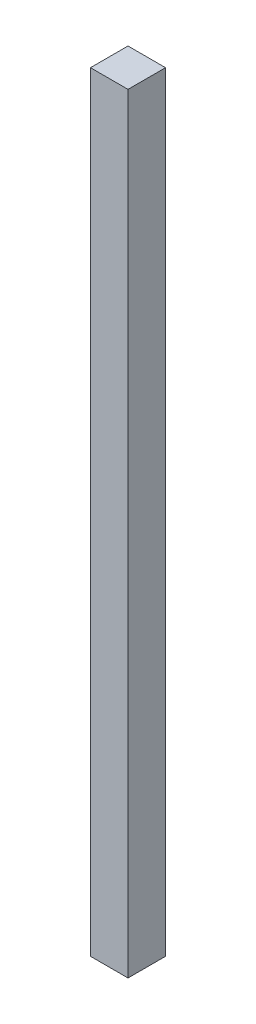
ISO-10303-21;
HEADER;
FILE_DESCRIPTION(('STEP AP214'),'2;1');
FILE_NAME('part.step','',(''),(''),'','','');
FILE_SCHEMA(('AUTOMOTIVE_DESIGN { 1 0 10303 214 1 1 1 1 }'));
ENDSEC;
DATA;
#1=APPLICATION_CONTEXT('core data for automotive mechanical design processes');
#2=APPLICATION_PROTOCOL_DEFINITION('international standard','automotive_design',2000,#1);
#3=PRODUCT_CONTEXT('',#1,'mechanical');
#4=PRODUCT('Part','Part','',(#3));
#5=PRODUCT_RELATED_PRODUCT_CATEGORY('part','',(#4));
#6=PRODUCT_DEFINITION_FORMATION('','',#4);
#7=PRODUCT_DEFINITION_CONTEXT('part definition',#1,'design');
#8=PRODUCT_DEFINITION('design','',#6,#7);
#9=PRODUCT_DEFINITION_SHAPE('','',#8);
#10=(LENGTH_UNIT() NAMED_UNIT(*) SI_UNIT(.MILLI.,.METRE.));
#11=(NAMED_UNIT(*) PLANE_ANGLE_UNIT() SI_UNIT($,.RADIAN.));
#12=(NAMED_UNIT(*) SI_UNIT($,.STERADIAN.) SOLID_ANGLE_UNIT());
#13=UNCERTAINTY_MEASURE_WITH_UNIT(LENGTH_MEASURE(1.E-05),#10,'distance_accuracy_value','');
#14=(GEOMETRIC_REPRESENTATION_CONTEXT(3) GLOBAL_UNCERTAINTY_ASSIGNED_CONTEXT((#13)) GLOBAL_UNIT_ASSIGNED_CONTEXT((#10,
#11,#12)) REPRESENTATION_CONTEXT('',''));
#15=CARTESIAN_POINT('',(0.,0.,0.));
#16=DIRECTION('',(0.,0.,1.));
#17=DIRECTION('',(1.,0.,0.));
#18=AXIS2_PLACEMENT_3D('',#15,#16,#17);
#19=CARTESIAN_POINT('',(-40.0000000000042,-4.97121842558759E-12,-40.));
#20=DIRECTION('',(-1.,0.,0.));
#21=DIRECTION('',(0.,0.,1.));
#22=AXIS2_PLACEMENT_3D('',#19,#20,#21);
#23=PLANE('',#22);
#24=DIRECTION('',(0.,-1.,0.));
#25=VECTOR('',#24,1.);
#26=CARTESIAN_POINT('',(-40.0000000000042,-4.97121842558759E-12,0.));
#27=LINE('',#26,#25);
#28=CARTESIAN_POINT('',(-40.0000000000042,819.999999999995,0.));
#29=VERTEX_POINT('',#28);
#30=CARTESIAN_POINT('',(-40.0000000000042,-4.97121842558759E-12,0.));
#31=VERTEX_POINT('',#30);
#32=EDGE_CURVE('E97',#29,#31,#27,.T.);
#33=ORIENTED_EDGE('',*,*,#32,.F.);
#34=DIRECTION('',(0.,0.,1.));
#35=VECTOR('',#34,1.);
#36=CARTESIAN_POINT('',(-40.0000000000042,819.999999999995,-40.));
#37=LINE('',#36,#35);
#38=CARTESIAN_POINT('',(-40.0000000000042,819.999999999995,-40.));
#39=VERTEX_POINT('',#38);
#40=EDGE_CURVE('E11',#39,#29,#37,.T.);
#41=ORIENTED_EDGE('',*,*,#40,.F.);
#42=DIRECTION('',(0.,-1.,0.));
#43=VECTOR('',#42,1.);
#44=CARTESIAN_POINT('',(-40.0000000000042,-4.97121842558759E-12,-40.));
#45=LINE('',#44,#43);
#46=CARTESIAN_POINT('',(-40.0000000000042,-4.97121842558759E-12,-40.));
#47=VERTEX_POINT('',#46);
#48=EDGE_CURVE('E91',#39,#47,#45,.T.);
#49=ORIENTED_EDGE('',*,*,#48,.T.);
#50=DIRECTION('',(0.,0.,1.));
#51=VECTOR('',#50,1.);
#52=CARTESIAN_POINT('',(-40.0000000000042,-4.97121842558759E-12,-40.));
#53=LINE('',#52,#51);
#54=EDGE_CURVE('E36',#47,#31,#53,.T.);
#55=ORIENTED_EDGE('',*,*,#54,.T.);
#56=EDGE_LOOP('',(#33,#41,#49,#55));
#57=FACE_BOUND('',#56,.T.);
#58=ADVANCED_FACE('F33',(#57),#23,.T.);
#59=CARTESIAN_POINT('',(-40.0000000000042,819.999999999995,-40.));
#60=DIRECTION('',(0.,1.,0.));
#61=DIRECTION('',(0.,0.,1.));
#62=AXIS2_PLACEMENT_3D('',#59,#60,#61);
#63=PLANE('',#62);
#64=DIRECTION('',(-1.,0.,0.));
#65=VECTOR('',#64,1.);
#66=CARTESIAN_POINT('',(-40.0000000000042,819.999999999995,0.));
#67=LINE('',#66,#65);
#68=CARTESIAN_POINT('',(-1.62729517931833E-11,819.999999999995,0.));
#69=VERTEX_POINT('',#68);
#70=EDGE_CURVE('E93',#69,#29,#67,.T.);
#71=ORIENTED_EDGE('',*,*,#70,.F.);
#72=DIRECTION('',(0.,0.,1.));
#73=VECTOR('',#72,1.);
#74=CARTESIAN_POINT('',(-1.62729517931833E-11,819.999999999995,-40.));
#75=LINE('',#74,#73);
#76=CARTESIAN_POINT('',(-1.62729517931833E-11,819.999999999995,-40.));
#77=VERTEX_POINT('',#76);
#78=EDGE_CURVE('E42',#77,#69,#75,.T.);
#79=ORIENTED_EDGE('',*,*,#78,.F.);
#80=DIRECTION('',(-1.,0.,0.));
#81=VECTOR('',#80,1.);
#82=CARTESIAN_POINT('',(-40.0000000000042,819.999999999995,-40.));
#83=LINE('',#82,#81);
#84=EDGE_CURVE('E88',#77,#39,#83,.T.);
#85=ORIENTED_EDGE('',*,*,#84,.T.);
#86=ORIENTED_EDGE('',*,*,#40,.T.);
#87=EDGE_LOOP('',(#71,#79,#85,#86));
#88=FACE_BOUND('',#87,.T.);
#89=ADVANCED_FACE('F107',(#88),#63,.T.);
#90=CARTESIAN_POINT('',(0.,0.,-40.));
#91=DIRECTION('',(1.,0.,0.));
#92=DIRECTION('',(0.,1.,0.));
#93=AXIS2_PLACEMENT_3D('',#90,#91,#92);
#94=PLANE('',#93);
#95=DIRECTION('',(0.,1.,0.));
#96=VECTOR('',#95,1.);
#97=CARTESIAN_POINT('',(0.,0.,0.));
#98=LINE('',#97,#96);
#99=CARTESIAN_POINT('',(0.,0.,0.));
#100=VERTEX_POINT('',#99);
#101=EDGE_CURVE('E83',#100,#69,#98,.T.);
#102=ORIENTED_EDGE('',*,*,#101,.F.);
#103=DIRECTION('',(0.,0.,1.));
#104=VECTOR('',#103,1.);
#105=CARTESIAN_POINT('',(0.,0.,-40.));
#106=LINE('',#105,#104);
#107=CARTESIAN_POINT('',(0.,0.,-40.));
#108=VERTEX_POINT('',#107);
#109=EDGE_CURVE('E78',#108,#100,#106,.T.);
#110=ORIENTED_EDGE('',*,*,#109,.F.);
#111=DIRECTION('',(0.,1.,0.));
#112=VECTOR('',#111,1.);
#113=CARTESIAN_POINT('',(0.,0.,-40.));
#114=LINE('',#113,#112);
#115=EDGE_CURVE('E81',#108,#77,#114,.T.);
#116=ORIENTED_EDGE('',*,*,#115,.T.);
#117=ORIENTED_EDGE('',*,*,#78,.T.);
#118=EDGE_LOOP('',(#102,#110,#116,#117));
#119=FACE_BOUND('',#118,.T.);
#120=ADVANCED_FACE('F80',(#119),#94,.T.);
#121=CARTESIAN_POINT('',(-40.0000000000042,-4.97121842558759E-12,-40.));
#122=DIRECTION('',(1.24280460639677E-13,-1.,0.));
#123=DIRECTION('',(1.,1.24280460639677E-13,0.));
#124=AXIS2_PLACEMENT_3D('',#121,#122,#123);
#125=PLANE('',#124);
#126=DIRECTION('',(1.,1.24280460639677E-13,0.));
#127=VECTOR('',#126,1.);
#128=CARTESIAN_POINT('',(-40.0000000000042,-4.97121842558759E-12,0.));
#129=LINE('',#128,#127);
#130=EDGE_CURVE('E100',#31,#100,#129,.T.);
#131=ORIENTED_EDGE('',*,*,#130,.F.);
#132=ORIENTED_EDGE('',*,*,#54,.F.);
#133=DIRECTION('',(1.,1.24280460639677E-13,0.));
#134=VECTOR('',#133,1.);
#135=CARTESIAN_POINT('',(-40.0000000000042,-4.97121842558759E-12,-40.));
#136=LINE('',#135,#134);
#137=EDGE_CURVE('E87',#47,#108,#136,.T.);
#138=ORIENTED_EDGE('',*,*,#137,.T.);
#139=ORIENTED_EDGE('',*,*,#109,.T.);
#140=EDGE_LOOP('',(#131,#132,#138,#139));
#141=FACE_BOUND('',#140,.T.);
#142=ADVANCED_FACE('F90',(#141),#125,.T.);
#143=CARTESIAN_POINT('',(0.,0.,-40.));
#144=DIRECTION('',(0.,0.,-1.));
#145=DIRECTION('',(-1.,0.,0.));
#146=AXIS2_PLACEMENT_3D('',#143,#144,#145);
#147=PLANE('',#146);
#148=ORIENTED_EDGE('',*,*,#48,.F.);
#149=ORIENTED_EDGE('',*,*,#84,.F.);
#150=ORIENTED_EDGE('',*,*,#115,.F.);
#151=ORIENTED_EDGE('',*,*,#137,.F.);
#152=EDGE_LOOP('',(#148,#149,#150,#151));
#153=FACE_BOUND('',#152,.T.);
#154=ADVANCED_FACE('F86',(#153),#147,.T.);
#155=CARTESIAN_POINT('',(0.,0.,0.));
#156=DIRECTION('',(0.,0.,-1.));
#157=DIRECTION('',(-1.,0.,0.));
#158=AXIS2_PLACEMENT_3D('',#155,#156,#157);
#159=PLANE('',#158);
#160=ORIENTED_EDGE('',*,*,#32,.T.);
#161=ORIENTED_EDGE('',*,*,#130,.T.);
#162=ORIENTED_EDGE('',*,*,#101,.T.);
#163=ORIENTED_EDGE('',*,*,#70,.T.);
#164=EDGE_LOOP('',(#160,#161,#162,#163));
#165=FACE_BOUND('',#164,.T.);
#166=ADVANCED_FACE('F106',(#165),#159,.F.);
#167=CLOSED_SHELL('',(#58,#89,#120,#142,#154,#166));
#168=MANIFOLD_SOLID_BREP('B2',#167);
#169=ADVANCED_BREP_SHAPE_REPRESENTATION('',(#18,#168),#14);
#170=SHAPE_DEFINITION_REPRESENTATION(#9,#169);
ENDSEC;
END-ISO-10303-21;
